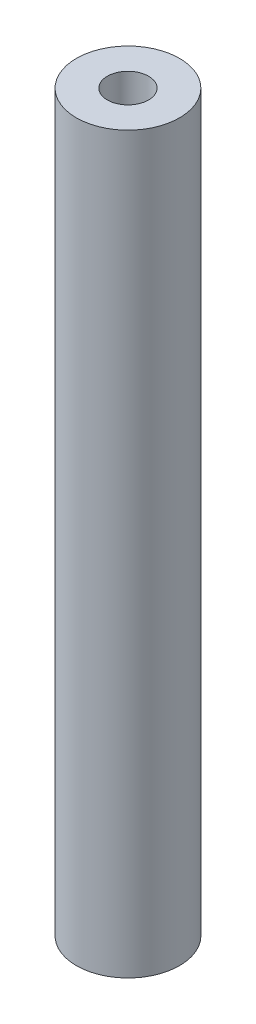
from build123d import *

# Parameters (mm, degrees)
SKETCH_1_R          = 6.25
EXTRUDE_1_DEPTH     = 89
SKETCH_2_R          = 2.5
CUT_EXTRUDE_1_DEPTH = 10
CUT_EXTRUDE_START   = -10
SKETCH_17_R         = 2.5
CUT_EXTRUDE_2_DEPTH = 10


with BuildPart() as part:
    # Sketch 1 → Extrude 1 (new body)
    with BuildSketch(Plane(origin=(0, 0, 0), x_dir=(1, 0, 0), z_dir=(0, 1, 0))):
        with Locations(Location((0, 0, 0), (0, 0, 270))):
            Circle(SKETCH_1_R)
    extrude(amount=EXTRUDE_1_DEPTH)

    # Sketch 2 → Cut-Extrude 1 (cut)
    with BuildSketch(Plane(origin=(0, 89, 0), x_dir=(1, 0, 0), z_dir=(0, 1, 0))):
        with Locations(Location((0, 0, 0), (0, 0, 270))):
            Circle(SKETCH_2_R)
    extrude(amount=-CUT_EXTRUDE_1_DEPTH, mode=Mode.SUBTRACT)

    # Sketch 17 → Cut-Extrude 2 (cut)
    with BuildSketch(Plane.XZ.offset(CUT_EXTRUDE_START)):
        with Locations(Location((0, 0, 0), (0, 0, 90))):
            Circle(SKETCH_17_R)
    extrude(amount=CUT_EXTRUDE_2_DEPTH, mode=Mode.SUBTRACT)


solid = part.part
